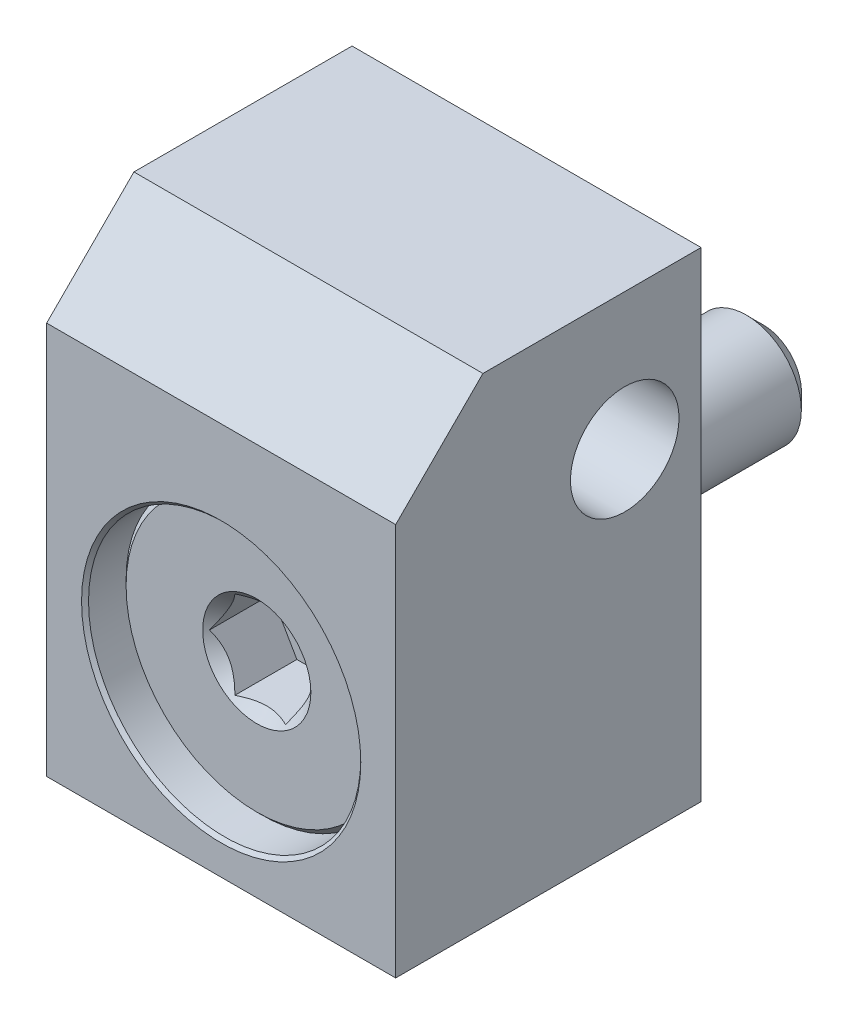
ISO-10303-21;
HEADER;
FILE_DESCRIPTION(('STEP AP214'),'2;1');
FILE_NAME('part.step','',(''),(''),'','','');
FILE_SCHEMA(('AUTOMOTIVE_DESIGN { 1 0 10303 214 1 1 1 1 }'));
ENDSEC;
DATA;
#1=APPLICATION_CONTEXT('core data for automotive mechanical design processes');
#2=APPLICATION_PROTOCOL_DEFINITION('international standard','automotive_design',2000,#1);
#3=PRODUCT_CONTEXT('',#1,'mechanical');
#4=PRODUCT('Part','Part','',(#3));
#5=PRODUCT_RELATED_PRODUCT_CATEGORY('part','',(#4));
#6=PRODUCT_DEFINITION_FORMATION('','',#4);
#7=PRODUCT_DEFINITION_CONTEXT('part definition',#1,'design');
#8=PRODUCT_DEFINITION('design','',#6,#7);
#9=PRODUCT_DEFINITION_SHAPE('','',#8);
#10=(LENGTH_UNIT() NAMED_UNIT(*) SI_UNIT(.MILLI.,.METRE.));
#11=(NAMED_UNIT(*) PLANE_ANGLE_UNIT() SI_UNIT($,.RADIAN.));
#12=(NAMED_UNIT(*) SI_UNIT($,.STERADIAN.) SOLID_ANGLE_UNIT());
#13=UNCERTAINTY_MEASURE_WITH_UNIT(LENGTH_MEASURE(1.E-05),#10,'distance_accuracy_value','');
#14=(GEOMETRIC_REPRESENTATION_CONTEXT(3) GLOBAL_UNCERTAINTY_ASSIGNED_CONTEXT((#13)) GLOBAL_UNIT_ASSIGNED_CONTEXT((#10,
#11,#12)) REPRESENTATION_CONTEXT('',''));
#15=CARTESIAN_POINT('',(0.,0.,0.));
#16=DIRECTION('',(0.,0.,1.));
#17=DIRECTION('',(1.,0.,0.));
#18=AXIS2_PLACEMENT_3D('',#15,#16,#17);
#19=CARTESIAN_POINT('',(1.8440856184,-3.19405,16.2683675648));
#20=DIRECTION('',(0.866025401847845,-0.500000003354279,0.));
#21=DIRECTION('',(0.500000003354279,0.866025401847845,0.));
#22=AXIS2_PLACEMENT_3D('',#19,#20,#21);
#23=PLANE('',#22);
#24=CARTESIAN_POINT('',(3.6881712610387,-1.7484970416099E-09,20.7820388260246));
#25=CARTESIAN_POINT('',(3.62478914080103,-0.109781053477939,20.7187175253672));
#26=CARTESIAN_POINT('',(3.56034726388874,-0.221397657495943,20.6591158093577));
#27=CARTESIAN_POINT('',(3.42894366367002,-0.448995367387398,20.5499876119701));
#28=CARTESIAN_POINT('',(3.36196945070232,-0.564998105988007,20.5005218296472));
#29=CARTESIAN_POINT('',(3.22691924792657,-0.798911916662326,20.4157866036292));
#30=CARTESIAN_POINT('',(3.15887763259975,-0.916763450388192,20.3803042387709));
#31=CARTESIAN_POINT('',(3.02129683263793,-1.15506038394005,20.325636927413));
#32=CARTESIAN_POINT('',(2.95176184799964,-1.27549850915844,20.3064111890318));
#33=CARTESIAN_POINT('',(2.83191525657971,-1.48307889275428,20.2890640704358));
#34=CARTESIAN_POINT('',(2.78175832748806,-1.56995324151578,20.2864968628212));
#35=CARTESIAN_POINT('',(2.68152611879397,-1.74356051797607,20.2908274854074));
#36=CARTESIAN_POINT('',(2.63145087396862,-1.83029338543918,20.2977286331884));
#37=CARTESIAN_POINT('',(2.53177486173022,-2.00293730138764,20.3206019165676));
#38=CARTESIAN_POINT('',(2.48217468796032,-2.08884732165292,20.3365841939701));
#39=CARTESIAN_POINT('',(2.38382622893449,-2.25919184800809,20.3767474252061));
#40=CARTESIAN_POINT('',(2.335077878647,-2.34362646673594,20.4009277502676));
#41=CARTESIAN_POINT('',(2.24854692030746,-2.49350248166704,20.4506707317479));
#42=CARTESIAN_POINT('',(2.21057255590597,-2.55927600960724,20.4749243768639));
#43=CARTESIAN_POINT('',(2.13530537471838,-2.68964259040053,20.5273394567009));
#44=CARTESIAN_POINT('',(2.09801257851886,-2.75423560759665,20.5555010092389));
#45=CARTESIAN_POINT('',(2.0242260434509,-2.88203763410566,20.6151008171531));
#46=CARTESIAN_POINT('',(1.98773020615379,-2.94525027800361,20.646528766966));
#47=CARTESIAN_POINT('',(1.91541422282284,-3.07050523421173,20.7122488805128));
#48=CARTESIAN_POINT('',(1.87959367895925,-3.13254823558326,20.7465392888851));
#49=CARTESIAN_POINT('',(1.84408561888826,-3.19404999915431,20.7820388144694));
#50=B_SPLINE_CURVE_WITH_KNOTS('',3,(#24,#25,#26,#27,#28,#29,#30,#31,#32,#33,#34,#35,#36,#37,#38,
#39,#40,#41,#42,#43,#44,#45,#46,#47,#48,#49),.UNSPECIFIED.,.F.,.F.,(4,2,2,2,2,2,2,2,2,2,2,2,4),
(0.,0.425392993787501,0.853263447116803,1.27434076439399,1.69435833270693,1.99497286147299,
2.2956927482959,2.59674914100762,2.89778244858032,3.1368524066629,3.37592957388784,
3.61427411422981,3.85247355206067),.UNSPECIFIED.);
#51=CARTESIAN_POINT('',(3.68817126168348,-8.94631599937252E-10,20.7820388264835));
#52=VERTEX_POINT('',#51);
#53=CARTESIAN_POINT('',(1.84408561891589,-3.19405,20.7820388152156));
#54=VERTEX_POINT('',#53);
#55=EDGE_CURVE('E229',#52,#54,#50,.T.);
#56=ORIENTED_EDGE('',*,*,#55,.F.);
#57=DIRECTION('',(0.,0.,1.));
#58=VECTOR('',#57,1.);
#59=CARTESIAN_POINT('',(3.6881712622,0.,18.5387442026));
#60=LINE('',#59,#58);
#61=CARTESIAN_POINT('',(3.6881712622,0.,16.2683675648));
#62=VERTEX_POINT('',#61);
#63=EDGE_CURVE('E160',#62,#52,#60,.T.);
#64=ORIENTED_EDGE('',*,*,#63,.F.);
#65=DIRECTION('',(0.50000000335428,0.866025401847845,0.));
#66=VECTOR('',#65,1.);
#67=CARTESIAN_POINT('',(2.7661284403,-1.597025,16.2683675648));
#68=LINE('',#67,#66);
#69=CARTESIAN_POINT('',(1.8440856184,-3.19405,16.2683675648));
#70=VERTEX_POINT('',#69);
#71=EDGE_CURVE('E156',#70,#62,#68,.T.);
#72=ORIENTED_EDGE('',*,*,#71,.F.);
#73=DIRECTION('',(0.,0.,1.));
#74=VECTOR('',#73,1.);
#75=CARTESIAN_POINT('',(1.8440856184,-3.19405,18.5387442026));
#76=LINE('',#75,#74);
#77=EDGE_CURVE('E159',#70,#54,#76,.T.);
#78=ORIENTED_EDGE('',*,*,#77,.T.);
#79=EDGE_LOOP('',(#56,#64,#72,#78));
#80=FACE_BOUND('',#79,.T.);
#81=ADVANCED_FACE('F14',(#80),#23,.F.);
#82=CARTESIAN_POINT('',(-1.8440856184,-3.19405,16.2683675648));
#83=DIRECTION('',(0.,-1.,0.));
#84=DIRECTION('',(1.,0.,0.));
#85=AXIS2_PLACEMENT_3D('',#82,#83,#84);
#86=PLANE('',#85);
#87=CARTESIAN_POINT('',(1.84408561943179,-3.19405,20.7820388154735));
#88=CARTESIAN_POINT('',(1.7173213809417,-3.19405,20.7187175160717));
#89=CARTESIAN_POINT('',(1.58843762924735,-3.19405,20.659115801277));
#90=CARTESIAN_POINT('',(1.32563043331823,-3.19405,20.549987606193));
#91=CARTESIAN_POINT('',(1.19168200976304,-3.19405,20.5005218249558));
#92=CARTESIAN_POINT('',(0.921581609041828,-3.19405,20.4157866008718));
#93=CARTESIAN_POINT('',(0.785498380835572,-3.19405,20.3803042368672));
#94=CARTESIAN_POINT('',(0.51033678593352,-3.19405,20.325636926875));
#95=CARTESIAN_POINT('',(0.371266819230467,-3.19405,20.306411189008));
#96=CARTESIAN_POINT('',(0.131573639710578,-3.19405,20.2890640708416));
#97=CARTESIAN_POINT('',(0.031259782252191,-3.19405,20.2864968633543));
#98=CARTESIAN_POINT('',(-0.169204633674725,-3.19405,20.2908274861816));
#99=CARTESIAN_POINT('',(-0.269355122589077,-3.19405,20.2977286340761));
#100=CARTESIAN_POINT('',(-0.468707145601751,-3.19405,20.3206019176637));
#101=CARTESIAN_POINT('',(-0.567907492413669,-3.19405,20.3365841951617));
#102=CARTESIAN_POINT('',(-0.764604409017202,-3.19405,20.3767474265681));
#103=CARTESIAN_POINT('',(-0.862101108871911,-3.19405,20.4009277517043));
#104=CARTESIAN_POINT('',(-1.03516302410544,-3.19405,20.450670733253));
#105=CARTESIAN_POINT('',(-1.11111175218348,-3.19405,20.4749243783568));
#106=CARTESIAN_POINT('',(-1.26164611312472,-3.19405,20.5273394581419));
#107=CARTESIAN_POINT('',(-1.3362317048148,-3.19405,20.5555010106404));
#108=CARTESIAN_POINT('',(-1.48380477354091,-3.19405,20.6151008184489));
#109=CARTESIAN_POINT('',(-1.55679644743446,-3.19405,20.6465287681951));
#110=CARTESIAN_POINT('',(-1.70142841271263,-3.19405,20.7122488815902));
#111=CARTESIAN_POINT('',(-1.77306949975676,-3.19405,20.7465392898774));
#112=CARTESIAN_POINT('',(-1.84408561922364,-3.19405,20.7820388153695));
#113=B_SPLINE_CURVE_WITH_KNOTS('',3,(#87,#88,#89,#90,#91,#92,#93,#94,#95,#96,#97,#98,#99,#100,
#101,#102,#103,#104,#105,#106,#107,#108,#109,#110,#111,#112),.UNSPECIFIED.,.F.,.F.,(4,2,2,2,2,2,
2,2,2,2,2,2,4),(0.,0.425392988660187,0.85326343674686,1.27434074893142,1.69435831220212,
1.99497284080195,2.29569272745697,2.59674912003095,2.89778242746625,3.13685238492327,
3.3759295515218,3.61427409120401,3.85247352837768),.UNSPECIFIED.);
#114=CARTESIAN_POINT('',(-1.84408561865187,-3.19404999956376,20.7820388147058));
#115=VERTEX_POINT('',#114);
#116=EDGE_CURVE('E196',#54,#115,#113,.T.);
#117=ORIENTED_EDGE('',*,*,#116,.F.);
#118=ORIENTED_EDGE('',*,*,#77,.F.);
#119=DIRECTION('',(1.,0.,0.));
#120=VECTOR('',#119,1.);
#121=CARTESIAN_POINT('',(0.,-3.19405,16.2683675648));
#122=LINE('',#121,#120);
#123=CARTESIAN_POINT('',(-1.8440856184,-3.19405,16.2683675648));
#124=VERTEX_POINT('',#123);
#125=EDGE_CURVE('E161',#124,#70,#122,.T.);
#126=ORIENTED_EDGE('',*,*,#125,.F.);
#127=DIRECTION('',(0.,0.,-1.));
#128=VECTOR('',#127,1.);
#129=CARTESIAN_POINT('',(-1.8440856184,-3.19405,18.5387442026));
#130=LINE('',#129,#128);
#131=EDGE_CURVE('E164',#115,#124,#130,.T.);
#132=ORIENTED_EDGE('',*,*,#131,.F.);
#133=EDGE_LOOP('',(#117,#118,#126,#132));
#134=FACE_BOUND('',#133,.T.);
#135=ADVANCED_FACE('F270',(#134),#86,.F.);
#136=CARTESIAN_POINT('',(-3.6881712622,0.,16.2683675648));
#137=DIRECTION('',(-0.866025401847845,-0.500000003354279,0.));
#138=DIRECTION('',(0.500000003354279,-0.866025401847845,0.));
#139=AXIS2_PLACEMENT_3D('',#136,#137,#138);
#140=PLANE('',#139);
#141=CARTESIAN_POINT('',(-1.84408561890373,-3.19404999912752,20.782038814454));
#142=CARTESIAN_POINT('',(-1.90746773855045,-3.08426894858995,20.7187175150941));
#143=CARTESIAN_POINT('',(-1.97190961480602,-2.97265234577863,20.6591158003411));
#144=CARTESIAN_POINT('',(-2.10331321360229,-2.74505463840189,20.5499876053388));
#145=CARTESIAN_POINT('',(-2.17028742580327,-2.62905190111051,20.5005218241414));
#146=CARTESIAN_POINT('',(-2.3053376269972,-2.39513809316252,20.4157866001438));
#147=CARTESIAN_POINT('',(-2.37337924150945,-2.27728656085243,20.3803042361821));
#148=CARTESIAN_POINT('',(-2.51096003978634,-2.03898963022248,20.3256369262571));
#149=CARTESIAN_POINT('',(-2.58049502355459,-1.91855150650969,20.3064111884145));
#150=CARTESIAN_POINT('',(-2.7003416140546,-1.71097112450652,20.2890640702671));
#151=CARTESIAN_POINT('',(-2.75049854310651,-1.62409677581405,20.2864968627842));
#152=CARTESIAN_POINT('',(-2.85073075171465,-1.45048949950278,20.2908274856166));
#153=CARTESIAN_POINT('',(-2.90080599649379,-1.36375663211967,20.297728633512));
#154=CARTESIAN_POINT('',(-3.00048200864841,-1.19111271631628,20.3206019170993));
#155=CARTESIAN_POINT('',(-3.0500821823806,-1.10520269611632,20.3365841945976));
#156=CARTESIAN_POINT('',(-3.14843064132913,-0.934858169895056,20.3767474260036));
#157=CARTESIAN_POINT('',(-3.19717899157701,-0.850423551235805,20.4009277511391));
#158=CARTESIAN_POINT('',(-3.28370995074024,-0.700547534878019,20.4506707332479));
#159=CARTESIAN_POINT('',(-3.32168431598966,-0.634774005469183,20.4749243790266));
#160=CARTESIAN_POINT('',(-3.39695149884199,-0.504407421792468,20.5273394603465));
#161=CARTESIAN_POINT('',(-3.43424429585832,-0.439814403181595,20.5555010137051));
#162=CARTESIAN_POINT('',(-3.50803083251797,-0.312012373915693,20.6151008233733));
#163=CARTESIAN_POINT('',(-3.54452667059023,-0.248799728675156,20.6465287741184));
#164=CARTESIAN_POINT('',(-3.61684265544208,-0.123544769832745,20.7122488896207));
#165=CARTESIAN_POINT('',(-3.65266320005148,-0.0615017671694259,20.7465392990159));
#166=CARTESIAN_POINT('',(-3.68817126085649,-2.32702668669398E-09,20.7820388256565));
#167=B_SPLINE_CURVE_WITH_KNOTS('',3,(#141,#142,#143,#144,#145,#146,#147,#148,#149,#150,#151,
#152,#153,#154,#155,#156,#157,#158,#159,#160,#161,#162,#163,#164,#165,#166),.UNSPECIFIED.,.F.,
.F.,(4,2,2,2,2,2,2,2,2,2,2,2,4),(0.,0.425392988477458,0.853263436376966,1.27434074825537,
1.69435831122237,1.99497283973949,2.29569272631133,2.59674911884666,2.89778242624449,
3.13685238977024,3.37592956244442,3.61427410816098,3.85247355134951),.UNSPECIFIED.);
#168=CARTESIAN_POINT('',(-3.68817126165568,9.42790922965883E-10,20.7820388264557));
#169=VERTEX_POINT('',#168);
#170=EDGE_CURVE('E187',#115,#169,#167,.T.);
#171=ORIENTED_EDGE('',*,*,#170,.F.);
#172=ORIENTED_EDGE('',*,*,#131,.T.);
#173=DIRECTION('',(0.50000000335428,-0.866025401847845,0.));
#174=VECTOR('',#173,1.);
#175=CARTESIAN_POINT('',(-2.7661284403,-1.597025,16.2683675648));
#176=LINE('',#175,#174);
#177=CARTESIAN_POINT('',(-3.6881712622,0.,16.2683675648));
#178=VERTEX_POINT('',#177);
#179=EDGE_CURVE('E165',#178,#124,#176,.T.);
#180=ORIENTED_EDGE('',*,*,#179,.F.);
#181=DIRECTION('',(0.,0.,-1.));
#182=VECTOR('',#181,1.);
#183=CARTESIAN_POINT('',(-3.6881712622,0.,18.5387442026));
#184=LINE('',#183,#182);
#185=EDGE_CURVE('E168',#169,#178,#184,.T.);
#186=ORIENTED_EDGE('',*,*,#185,.F.);
#187=EDGE_LOOP('',(#171,#172,#180,#186));
#188=FACE_BOUND('',#187,.T.);
#189=ADVANCED_FACE('F203',(#188),#140,.F.);
#190=CARTESIAN_POINT('',(-1.8440856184,3.19405,16.2683675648));
#191=DIRECTION('',(-0.866025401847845,0.500000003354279,0.));
#192=DIRECTION('',(-0.500000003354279,-0.866025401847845,0.));
#193=AXIS2_PLACEMENT_3D('',#190,#191,#192);
#194=PLANE('',#193);
#195=CARTESIAN_POINT('',(-3.68817125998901,1.52885915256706E-09,20.7820388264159));
#196=CARTESIAN_POINT('',(-3.6247891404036,0.109781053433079,20.7187175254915));
#197=CARTESIAN_POINT('',(-3.56034726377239,0.221397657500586,20.6591158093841));
#198=CARTESIAN_POINT('',(-3.42894366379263,0.44899536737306,20.5499876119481));
#199=CARTESIAN_POINT('',(-3.36196945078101,0.564998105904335,20.5005218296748));
#200=CARTESIAN_POINT('',(-3.22691924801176,0.79891191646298,20.4157866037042));
#201=CARTESIAN_POINT('',(-3.15887763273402,0.916763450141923,20.3803042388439));
#202=CARTESIAN_POINT('',(-3.02129683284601,1.15506038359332,20.3256369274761));
#203=CARTESIAN_POINT('',(-2.95176184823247,1.27549850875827,20.3064111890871));
#204=CARTESIAN_POINT('',(-2.83191525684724,1.48307889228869,20.289064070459));
#205=CARTESIAN_POINT('',(-2.78175832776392,1.56995324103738,20.2864968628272));
#206=CARTESIAN_POINT('',(-2.68152611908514,1.74356051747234,20.290827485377));
#207=CARTESIAN_POINT('',(-2.63145087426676,1.83029338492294,20.2977286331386));
#208=CARTESIAN_POINT('',(-2.53177486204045,2.00293730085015,20.3206019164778));
#209=CARTESIAN_POINT('',(-2.48217468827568,2.08884732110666,20.3365841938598));
#210=CARTESIAN_POINT('',(-2.38382622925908,2.25919184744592,20.3767474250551));
#211=CARTESIAN_POINT('',(-2.3350778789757,2.34362646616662,20.4009277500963));
#212=CARTESIAN_POINT('',(-2.24854692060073,2.49350248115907,20.4506707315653));
#213=CARTESIAN_POINT('',(-2.21057255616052,2.55927600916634,20.4749243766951));
#214=CARTESIAN_POINT('',(-2.13530537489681,2.68964259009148,20.5273394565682));
#215=CARTESIAN_POINT('',(-2.09801257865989,2.75423560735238,20.5555010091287));
#216=CARTESIAN_POINT('',(-2.02422604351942,2.88203763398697,20.6151008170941));
#217=CARTESIAN_POINT('',(-1.98773020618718,2.94525027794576,20.6465287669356));
#218=CARTESIAN_POINT('',(-1.91541422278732,3.07050523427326,20.7122488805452));
#219=CARTESIAN_POINT('',(-1.87959367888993,3.13254823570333,20.7465392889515));
#220=CARTESIAN_POINT('',(-1.84408561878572,3.19404999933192,20.782038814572));
#221=B_SPLINE_CURVE_WITH_KNOTS('',3,(#195,#196,#197,#198,#199,#200,#201,#202,#203,#204,#205,
#206,#207,#208,#209,#210,#211,#212,#213,#214,#215,#216,#217,#218,#219,#220),.UNSPECIFIED.,.F.,
.F.,(4,2,2,2,2,2,2,2,2,2,2,2,4),(0.,0.425392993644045,0.853263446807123,1.27434076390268,
1.69435833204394,1.99497286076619,2.29569274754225,2.59674914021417,2.8977824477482,
3.13685240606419,3.37592957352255,3.61427411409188,3.85247355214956),.UNSPECIFIED.);
#222=CARTESIAN_POINT('',(-1.84408561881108,3.19405,20.7820388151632));
#223=VERTEX_POINT('',#222);
#224=EDGE_CURVE('E155',#169,#223,#221,.T.);
#225=ORIENTED_EDGE('',*,*,#224,.F.);
#226=ORIENTED_EDGE('',*,*,#185,.T.);
#227=DIRECTION('',(-0.50000000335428,-0.866025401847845,0.));
#228=VECTOR('',#227,1.);
#229=CARTESIAN_POINT('',(-2.7661284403,1.597025,16.2683675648));
#230=LINE('',#229,#228);
#231=CARTESIAN_POINT('',(-1.8440856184,3.19405,16.2683675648));
#232=VERTEX_POINT('',#231);
#233=EDGE_CURVE('E90',#232,#178,#230,.T.);
#234=ORIENTED_EDGE('',*,*,#233,.F.);
#235=DIRECTION('',(0.,0.,1.));
#236=VECTOR('',#235,1.);
#237=CARTESIAN_POINT('',(-1.8440856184,3.19405,18.5387442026));
#238=LINE('',#237,#236);
#239=EDGE_CURVE('E170',#232,#223,#238,.T.);
#240=ORIENTED_EDGE('',*,*,#239,.T.);
#241=EDGE_LOOP('',(#225,#226,#234,#240));
#242=FACE_BOUND('',#241,.T.);
#243=ADVANCED_FACE('F257',(#242),#194,.F.);
#244=CARTESIAN_POINT('',(1.8440856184,3.19405,16.2683675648));
#245=DIRECTION('',(0.,1.,0.));
#246=DIRECTION('',(-1.,0.,0.));
#247=AXIS2_PLACEMENT_3D('',#244,#245,#246);
#248=PLANE('',#247);
#249=CARTESIAN_POINT('',(-1.84408561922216,3.19405,20.7820388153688));
#250=CARTESIAN_POINT('',(-1.71732138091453,3.19405,20.7187175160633));
#251=CARTESIAN_POINT('',(-1.58843762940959,3.19405,20.6591158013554));
#252=CARTESIAN_POINT('',(-1.32563043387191,3.19405,20.5499876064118));
#253=CARTESIAN_POINT('',(-1.19168201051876,3.19405,20.5005218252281));
#254=CARTESIAN_POINT('',(-0.921581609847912,3.19405,20.4157866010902));
#255=CARTESIAN_POINT('',(-0.78549838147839,3.19405,20.3803042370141));
#256=CARTESIAN_POINT('',(-0.510336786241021,3.19405,20.325636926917));
#257=CARTESIAN_POINT('',(-0.37126681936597,3.19405,20.3064111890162));
#258=CARTESIAN_POINT('',(-0.131573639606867,3.19405,20.2890640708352));
#259=CARTESIAN_POINT('',(-0.0312597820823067,3.19405,20.2864968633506));
#260=CARTESIAN_POINT('',(0.169204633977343,3.19405,20.2908274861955));
#261=CARTESIAN_POINT('',(0.269355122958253,3.19405,20.2977286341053));
#262=CARTESIAN_POINT('',(0.468707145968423,3.19405,20.320601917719));
#263=CARTESIAN_POINT('',(0.567907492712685,3.19405,20.3365841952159));
#264=CARTESIAN_POINT('',(0.764604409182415,3.19405,20.3767474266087));
#265=CARTESIAN_POINT('',(0.862101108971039,3.19405,20.4009277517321));
#266=CARTESIAN_POINT('',(1.03516300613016,3.19405,20.450670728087));
#267=CARTESIAN_POINT('',(1.11111171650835,3.19405,20.4749243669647));
#268=CARTESIAN_POINT('',(1.26164604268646,3.19405,20.5273394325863));
#269=CARTESIAN_POINT('',(1.33623161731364,3.19405,20.5555009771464));
#270=CARTESIAN_POINT('',(1.4838046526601,3.19405,20.6151007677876));
#271=CARTESIAN_POINT('',(1.55679631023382,3.19405,20.6465287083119));
#272=CARTESIAN_POINT('',(1.70142824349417,3.19405,20.7122488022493));
#273=CARTESIAN_POINT('',(1.77306931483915,3.19405,20.7465392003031));
#274=CARTESIAN_POINT('',(1.84408541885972,3.19405,20.7820387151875));
#275=B_SPLINE_CURVE_WITH_KNOTS('',3,(#249,#250,#251,#252,#253,#254,#255,#256,#257,#258,#259,
#260,#261,#262,#263,#264,#265,#266,#267,#268,#269,#270,#271,#272,#273,#274),.UNSPECIFIED.,.F.,
.F.,(4,2,2,2,2,2,2,2,2,2,2,2,4),(0.,0.425392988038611,0.853263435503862,1.27434074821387,
1.6943583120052,1.99497284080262,2.29569272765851,2.59674912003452,2.89778242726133,
3.13685232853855,3.37592943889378,3.61427392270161,3.85247330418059),.UNSPECIFIED.);
#276=CARTESIAN_POINT('',(1.84408560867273,3.19405001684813,20.782038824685));
#277=VERTEX_POINT('',#276);
#278=EDGE_CURVE('E57',#223,#277,#275,.T.);
#279=ORIENTED_EDGE('',*,*,#278,.F.);
#280=ORIENTED_EDGE('',*,*,#239,.F.);
#281=DIRECTION('',(-1.,0.,0.));
#282=VECTOR('',#281,1.);
#283=CARTESIAN_POINT('',(0.,3.19405,16.2683675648));
#284=LINE('',#283,#282);
#285=CARTESIAN_POINT('',(1.8440856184,3.19405,16.2683675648));
#286=VERTEX_POINT('',#285);
#287=EDGE_CURVE('E94',#286,#232,#284,.T.);
#288=ORIENTED_EDGE('',*,*,#287,.F.);
#289=DIRECTION('',(0.,0.,1.));
#290=VECTOR('',#289,1.);
#291=CARTESIAN_POINT('',(1.8440856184,3.19405,18.5387442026));
#292=LINE('',#291,#290);
#293=EDGE_CURVE('E172',#286,#277,#292,.T.);
#294=ORIENTED_EDGE('',*,*,#293,.T.);
#295=EDGE_LOOP('',(#279,#280,#288,#294));
#296=FACE_BOUND('',#295,.T.);
#297=ADVANCED_FACE('F244',(#296),#248,.F.);
#298=CARTESIAN_POINT('',(3.6881712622,0.,16.2683675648));
#299=DIRECTION('',(0.866025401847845,0.500000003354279,0.));
#300=DIRECTION('',(-0.500000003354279,0.866025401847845,0.));
#301=AXIS2_PLACEMENT_3D('',#298,#299,#300);
#302=PLANE('',#301);
#303=CARTESIAN_POINT('',(1.84408553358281,3.19404997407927,20.7820388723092));
#304=CARTESIAN_POINT('',(1.90746769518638,3.08426896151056,20.7187175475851));
#305=CARTESIAN_POINT('',(1.97190958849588,2.97265237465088,20.6591158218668));
#306=CARTESIAN_POINT('',(2.10331319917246,2.74505468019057,20.5499876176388));
#307=CARTESIAN_POINT('',(2.17028740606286,2.62905193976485,20.5005218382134));
#308=CARTESIAN_POINT('',(2.30533760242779,2.3951381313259,20.4157866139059));
#309=CARTESIAN_POINT('',(2.37337921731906,2.27728660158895,20.3803042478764));
#310=CARTESIAN_POINT('',(2.51096001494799,2.03898967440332,20.3256369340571));
#311=CARTESIAN_POINT('',(2.58049499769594,1.91855155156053,20.3064111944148));
#312=CARTESIAN_POINT('',(2.7003415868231,1.71097117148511,20.2890640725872));
#313=CARTESIAN_POINT('',(2.75049851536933,1.62409682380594,20.2864968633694));
#314=CARTESIAN_POINT('',(2.85073072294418,1.45048954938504,20.2908274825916));
#315=CARTESIAN_POINT('',(2.9008059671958,1.36375668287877,20.2977286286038));
#316=CARTESIAN_POINT('',(3.00048197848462,1.19111276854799,20.3206019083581));
#317=CARTESIAN_POINT('',(3.05008215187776,1.10520274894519,20.3365841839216));
#318=CARTESIAN_POINT('',(3.14843061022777,0.934858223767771,20.3767474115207));
#319=CARTESIAN_POINT('',(3.19717896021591,0.850423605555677,20.4009277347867));
#320=CARTESIAN_POINT('',(3.28370992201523,0.700547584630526,20.4506707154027));
#321=CARTESIAN_POINT('',(3.3216842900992,0.634774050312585,20.474924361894));
#322=CARTESIAN_POINT('',(3.39695147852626,0.504407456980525,20.5273394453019));
#323=CARTESIAN_POINT('',(3.43424427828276,0.439814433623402,20.5555010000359));
#324=CARTESIAN_POINT('',(3.50803082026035,0.312012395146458,20.6151008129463));
#325=CARTESIAN_POINT('',(3.5445266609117,0.24879974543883,20.6465287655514));
#326=CARTESIAN_POINT('',(3.61684265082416,0.123544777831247,20.7122488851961));
#327=CARTESIAN_POINT('',(3.6526631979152,0.0615017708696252,20.7465392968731));
#328=CARTESIAN_POINT('',(3.68817126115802,1.8047641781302E-09,20.782038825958));
#329=B_SPLINE_CURVE_WITH_KNOTS('',3,(#303,#304,#305,#306,#307,#308,#309,#310,#311,#312,#313,
#314,#315,#316,#317,#318,#319,#320,#321,#322,#323,#324,#325,#326,#327,#328),.UNSPECIFIED.,.F.,
.F.,(4,2,2,2,2,2,2,2,2,2,2,2,4),(0.,0.425392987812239,0.853263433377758,1.27434074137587,
1.6943583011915,1.99497282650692,2.29569270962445,2.59674909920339,2.89778240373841,
3.1368523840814,3.37592957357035,3.61427413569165,3.85247359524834),.UNSPECIFIED.);
#330=EDGE_CURVE('E50',#277,#52,#329,.T.);
#331=ORIENTED_EDGE('',*,*,#330,.F.);
#332=ORIENTED_EDGE('',*,*,#293,.F.);
#333=DIRECTION('',(-0.50000000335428,0.866025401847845,0.));
#334=VECTOR('',#333,1.);
#335=CARTESIAN_POINT('',(2.7661284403,1.597025,16.2683675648));
#336=LINE('',#335,#334);
#337=EDGE_CURVE('E173',#62,#286,#336,.T.);
#338=ORIENTED_EDGE('',*,*,#337,.F.);
#339=ORIENTED_EDGE('',*,*,#63,.T.);
#340=EDGE_LOOP('',(#331,#332,#338,#339));
#341=FACE_BOUND('',#340,.T.);
#342=ADVANCED_FACE('F240',(#341),#302,.F.);
#343=CARTESIAN_POINT('',(-3.6881712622,-3.19405,16.2683675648));
#344=DIRECTION('',(0.,0.,1.));
#345=DIRECTION('',(1.,0.,0.));
#346=AXIS2_PLACEMENT_3D('',#343,#344,#345);
#347=PLANE('',#346);
#348=ORIENTED_EDGE('',*,*,#179,.T.);
#349=ORIENTED_EDGE('',*,*,#125,.T.);
#350=ORIENTED_EDGE('',*,*,#71,.T.);
#351=ORIENTED_EDGE('',*,*,#337,.T.);
#352=ORIENTED_EDGE('',*,*,#287,.T.);
#353=ORIENTED_EDGE('',*,*,#233,.T.);
#354=EDGE_LOOP('',(#348,#349,#350,#351,#352,#353));
#355=FACE_BOUND('',#354,.T.);
#356=ADVANCED_FACE('F243',(#355),#347,.T.);
#357=CARTESIAN_POINT('',(-9.62387712,-9.62387712,21.0308675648));
#358=DIRECTION('',(0.,0.,1.));
#359=DIRECTION('',(1.,0.,0.));
#360=AXIS2_PLACEMENT_3D('',#357,#358,#359);
#361=PLANE('',#360);
#362=CARTESIAN_POINT('',(0.,0.,21.0308675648));
#363=DIRECTION('',(0.,0.,1.));
#364=DIRECTION('',(1.,0.,0.));
#365=AXIS2_PLACEMENT_3D('',#362,#363,#364);
#366=CIRCLE('',#365,3.937);
#367=CARTESIAN_POINT('',(3.937,0.,21.0308675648));
#368=VERTEX_POINT('',#367);
#369=EDGE_CURVE('E29',#368,#368,#366,.T.);
#370=ORIENTED_EDGE('',*,*,#369,.F.);
#371=EDGE_LOOP('',(#370));
#372=FACE_BOUND('',#371,.T.);
#373=CARTESIAN_POINT('',(0.,0.,21.0308675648));
#374=DIRECTION('',(0.,0.,-1.));
#375=DIRECTION('',(-1.,0.,0.));
#376=AXIS2_PLACEMENT_3D('',#373,#374,#375);
#377=CIRCLE('',#376,9.50976);
#378=CARTESIAN_POINT('',(-9.50976,0.,21.0308675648));
#379=VERTEX_POINT('',#378);
#380=EDGE_CURVE('E176',#379,#379,#377,.F.);
#381=ORIENTED_EDGE('',*,*,#380,.T.);
#382=EDGE_LOOP('',(#381));
#383=FACE_BOUND('',#382,.T.);
#384=ADVANCED_FACE('F214',(#372,#383),#361,.T.);
#385=CARTESIAN_POINT('',(0.,0.,21.0308675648));
#386=DIRECTION('',(0.,0.,-1.));
#387=DIRECTION('',(-1.,0.,0.));
#388=AXIS2_PLACEMENT_3D('',#385,#386,#387);
#389=CONICAL_SURFACE('',#388,9.50976,0.785398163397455);
#390=ORIENTED_EDGE('',*,*,#380,.F.);
#391=EDGE_LOOP('',(#390));
#392=FACE_BOUND('',#391,.T.);
#393=CARTESIAN_POINT('',(0.,0.,20.6346275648));
#394=DIRECTION('',(0.,0.,-1.));
#395=DIRECTION('',(-1.,0.,0.));
#396=AXIS2_PLACEMENT_3D('',#393,#394,#395);
#397=CIRCLE('',#396,9.906);
#398=CARTESIAN_POINT('',(-9.906,0.,20.6346275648));
#399=VERTEX_POINT('',#398);
#400=EDGE_CURVE('E336',#399,#399,#397,.T.);
#401=ORIENTED_EDGE('',*,*,#400,.F.);
#402=EDGE_LOOP('',(#401));
#403=FACE_BOUND('',#402,.T.);
#404=ADVANCED_FACE('F253',(#392,#403),#389,.T.);
#405=CARTESIAN_POINT('',(0.,0.,23.368));
#406=DIRECTION('',(0.,0.,-1.));
#407=DIRECTION('',(-1.,0.,0.));
#408=AXIS2_PLACEMENT_3D('',#405,#406,#407);
#409=CYLINDRICAL_SURFACE('',#408,9.906);
#410=ORIENTED_EDGE('',*,*,#400,.T.);
#411=EDGE_LOOP('',(#410));
#412=FACE_BOUND('',#411,.T.);
#413=CARTESIAN_POINT('',(0.,0.,23.368));
#414=DIRECTION('',(0.,0.,1.));
#415=DIRECTION('',(1.,0.,0.));
#416=AXIS2_PLACEMENT_3D('',#413,#414,#415);
#417=CIRCLE('',#416,9.906);
#418=CARTESIAN_POINT('',(9.906,0.,23.368));
#419=VERTEX_POINT('',#418);
#420=EDGE_CURVE('E337',#419,#419,#417,.F.);
#421=ORIENTED_EDGE('',*,*,#420,.F.);
#422=EDGE_LOOP('',(#421));
#423=FACE_BOUND('',#422,.T.);
#424=ADVANCED_FACE('F322',(#412,#423),#409,.F.);
#425=CARTESIAN_POINT('',(0.,0.,23.368));
#426=DIRECTION('',(0.,0.,1.));
#427=DIRECTION('',(1.,0.,0.));
#428=AXIS2_PLACEMENT_3D('',#425,#426,#427);
#429=CONICAL_SURFACE('',#428,9.906,0.785398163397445);
#430=CARTESIAN_POINT('',(0.,0.,23.622));
#431=DIRECTION('',(0.,0.,1.));
#432=DIRECTION('',(1.,0.,0.));
#433=AXIS2_PLACEMENT_3D('',#430,#431,#432);
#434=CIRCLE('',#433,10.16);
#435=CARTESIAN_POINT('',(10.16,0.,23.622));
#436=VERTEX_POINT('',#435);
#437=EDGE_CURVE('E340',#436,#436,#434,.T.);
#438=ORIENTED_EDGE('',*,*,#437,.T.);
#439=EDGE_LOOP('',(#438));
#440=FACE_BOUND('',#439,.T.);
#441=ORIENTED_EDGE('',*,*,#420,.T.);
#442=EDGE_LOOP('',(#441));
#443=FACE_BOUND('',#442,.T.);
#444=ADVANCED_FACE('F318',(#440,#443),#429,.F.);
#445=CARTESIAN_POINT('',(0.,0.,-14.986));
#446=DIRECTION('',(0.,0.,1.));
#447=DIRECTION('',(1.,0.,0.));
#448=AXIS2_PLACEMENT_3D('',#445,#446,#447);
#449=CYLINDRICAL_SURFACE('',#448,4.000000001);
#450=CARTESIAN_POINT('',(0.,0.,-14.6));
#451=DIRECTION('',(0.,0.,-1.));
#452=DIRECTION('',(-1.,0.,0.));
#453=AXIS2_PLACEMENT_3D('',#450,#451,#452);
#454=CIRCLE('',#453,4.000000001);
#455=CARTESIAN_POINT('',(-4.000000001,0.,-14.6));
#456=VERTEX_POINT('',#455);
#457=EDGE_CURVE('E9',#456,#456,#454,.F.);
#458=ORIENTED_EDGE('',*,*,#457,.T.);
#459=EDGE_LOOP('',(#458));
#460=FACE_BOUND('',#459,.T.);
#461=CARTESIAN_POINT('',(0.,0.,0.));
#462=DIRECTION('',(0.,0.,1.));
#463=DIRECTION('',(1.,0.,0.));
#464=AXIS2_PLACEMENT_3D('',#461,#462,#463);
#465=CIRCLE('',#464,4.000000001);
#466=CARTESIAN_POINT('',(4.000000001,0.,0.));
#467=VERTEX_POINT('',#466);
#468=EDGE_CURVE('E347',#467,#467,#465,.T.);
#469=ORIENTED_EDGE('',*,*,#468,.F.);
#470=EDGE_LOOP('',(#469));
#471=FACE_BOUND('',#470,.T.);
#472=ADVANCED_FACE('F314',(#460,#471),#449,.T.);
#473=CARTESIAN_POINT('',(-7.968488,-7.968488,0.));
#474=DIRECTION('',(0.,0.,1.));
#475=DIRECTION('',(1.,0.,0.));
#476=AXIS2_PLACEMENT_3D('',#473,#474,#475);
#477=PLANE('',#476);
#478=ORIENTED_EDGE('',*,*,#468,.T.);
#479=EDGE_LOOP('',(#478));
#480=FACE_BOUND('',#479,.T.);
#481=CARTESIAN_POINT('',(0.,0.,0.));
#482=DIRECTION('',(0.,0.,-1.));
#483=DIRECTION('',(-1.,0.,0.));
#484=AXIS2_PLACEMENT_3D('',#481,#482,#483);
#485=CIRCLE('',#484,7.874);
#486=CARTESIAN_POINT('',(-7.874,0.,0.));
#487=VERTEX_POINT('',#486);
#488=EDGE_CURVE('E350',#487,#487,#485,.F.);
#489=ORIENTED_EDGE('',*,*,#488,.F.);
#490=EDGE_LOOP('',(#489));
#491=FACE_BOUND('',#490,.T.);
#492=ADVANCED_FACE('F310',(#480,#491),#477,.F.);
#493=CARTESIAN_POINT('',(0.,0.,1.397));
#494=DIRECTION('',(0.,0.,-1.));
#495=DIRECTION('',(-1.,0.,0.));
#496=AXIS2_PLACEMENT_3D('',#493,#494,#495);
#497=CYLINDRICAL_SURFACE('',#496,7.874);
#498=CARTESIAN_POINT('',(0.,0.,1.397));
#499=DIRECTION('',(0.,0.,-1.));
#500=DIRECTION('',(-1.,0.,0.));
#501=AXIS2_PLACEMENT_3D('',#498,#499,#500);
#502=CIRCLE('',#501,7.874);
#503=CARTESIAN_POINT('',(-7.874,0.,1.397));
#504=VERTEX_POINT('',#503);
#505=EDGE_CURVE('E353',#504,#504,#502,.F.);
#506=ORIENTED_EDGE('',*,*,#505,.F.);
#507=EDGE_LOOP('',(#506));
#508=FACE_BOUND('',#507,.T.);
#509=ORIENTED_EDGE('',*,*,#488,.T.);
#510=EDGE_LOOP('',(#509));
#511=FACE_BOUND('',#510,.T.);
#512=ADVANCED_FACE('F306',(#508,#511),#497,.T.);
#513=CARTESIAN_POINT('',(-12.7,-12.319,1.397));
#514=DIRECTION('',(1.,0.,0.));
#515=DIRECTION('',(0.,1.,0.));
#516=AXIS2_PLACEMENT_3D('',#513,#514,#515);
#517=PLANE('',#516);
#518=CARTESIAN_POINT('',(-12.7,12.66825,6.95325000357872));
#519=DIRECTION('',(1.,0.,0.));
#520=DIRECTION('',(0.,0.,-1.));
#521=AXIS2_PLACEMENT_3D('',#518,#519,#520);
#522=CIRCLE('',#521,3.95);
#523=CARTESIAN_POINT('',(-12.7,12.66825,3.00325000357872));
#524=VERTEX_POINT('',#523);
#525=EDGE_CURVE('E183',#524,#524,#522,.T.);
#526=ORIENTED_EDGE('',*,*,#525,.T.);
#527=EDGE_LOOP('',(#526));
#528=FACE_BOUND('',#527,.T.);
#529=DIRECTION('',(0.,1.,0.));
#530=VECTOR('',#529,1.);
#531=CARTESIAN_POINT('',(-12.7,5.1435,1.397));
#532=LINE('',#531,#530);
#533=CARTESIAN_POINT('',(-12.7,-12.319,1.397));
#534=VERTEX_POINT('',#533);
#535=CARTESIAN_POINT('',(-12.7,22.606,1.397));
#536=VERTEX_POINT('',#535);
#537=EDGE_CURVE('E102',#534,#536,#532,.T.);
#538=ORIENTED_EDGE('',*,*,#537,.F.);
#539=DIRECTION('',(0.,0.,1.));
#540=VECTOR('',#539,1.);
#541=CARTESIAN_POINT('',(-12.7,-12.319,12.5095));
#542=LINE('',#541,#540);
#543=CARTESIAN_POINT('',(-12.7,-12.319,23.622));
#544=VERTEX_POINT('',#543);
#545=EDGE_CURVE('E356',#534,#544,#542,.T.);
#546=ORIENTED_EDGE('',*,*,#545,.T.);
#547=DIRECTION('',(0.,-1.,0.));
#548=VECTOR('',#547,1.);
#549=CARTESIAN_POINT('',(-12.7,5.1435,23.622));
#550=LINE('',#549,#548);
#551=CARTESIAN_POINT('',(-12.7,16.256,23.622));
#552=VERTEX_POINT('',#551);
#553=EDGE_CURVE('E358',#552,#544,#550,.T.);
#554=ORIENTED_EDGE('',*,*,#553,.F.);
#555=DIRECTION('',(0.,0.707106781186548,-0.707106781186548));
#556=VECTOR('',#555,1.);
#557=CARTESIAN_POINT('',(-12.7,16.256,23.622));
#558=LINE('',#557,#556);
#559=CARTESIAN_POINT('',(-12.7,22.606,17.272));
#560=VERTEX_POINT('',#559);
#561=EDGE_CURVE('E142',#560,#552,#558,.F.);
#562=ORIENTED_EDGE('',*,*,#561,.F.);
#563=DIRECTION('',(0.,0.,1.));
#564=VECTOR('',#563,1.);
#565=CARTESIAN_POINT('',(-12.7,22.606,12.5095));
#566=LINE('',#565,#564);
#567=EDGE_CURVE('E361',#536,#560,#566,.T.);
#568=ORIENTED_EDGE('',*,*,#567,.F.);
#569=EDGE_LOOP('',(#538,#546,#554,#562,#568));
#570=FACE_BOUND('',#569,.T.);
#571=CARTESIAN_POINT('',(-12.7,16.637,6.98500000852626));
#572=VERTEX_POINT('',#571);
#573=VERTEX_LOOP('',#572);
#574=FACE_BOUND('',#573,.T.);
#575=CARTESIAN_POINT('',(-12.7,8.6995,6.9850000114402));
#576=VERTEX_POINT('',#575);
#577=VERTEX_LOOP('',#576);
#578=FACE_BOUND('',#577,.T.);
#579=ADVANCED_FACE('F302',(#528,#570,#574,#578),#517,.F.);
#580=CARTESIAN_POINT('',(12.7,-12.319,1.397));
#581=DIRECTION('',(0.,1.,0.));
#582=DIRECTION('',(-1.,0.,0.));
#583=AXIS2_PLACEMENT_3D('',#580,#581,#582);
#584=PLANE('',#583);
#585=DIRECTION('',(1.,0.,0.));
#586=VECTOR('',#585,1.);
#587=CARTESIAN_POINT('',(0.,-12.319,1.397));
#588=LINE('',#587,#586);
#589=CARTESIAN_POINT('',(12.7,-12.319,1.397));
#590=VERTEX_POINT('',#589);
#591=EDGE_CURVE('E365',#534,#590,#588,.T.);
#592=ORIENTED_EDGE('',*,*,#591,.T.);
#593=DIRECTION('',(0.,0.,-1.));
#594=VECTOR('',#593,1.);
#595=CARTESIAN_POINT('',(12.7,-12.319,12.5095));
#596=LINE('',#595,#594);
#597=CARTESIAN_POINT('',(12.7,-12.319,23.622));
#598=VERTEX_POINT('',#597);
#599=EDGE_CURVE('E367',#598,#590,#596,.T.);
#600=ORIENTED_EDGE('',*,*,#599,.F.);
#601=DIRECTION('',(1.,0.,0.));
#602=VECTOR('',#601,1.);
#603=CARTESIAN_POINT('',(0.,-12.319,23.622));
#604=LINE('',#603,#602);
#605=EDGE_CURVE('E132',#544,#598,#604,.T.);
#606=ORIENTED_EDGE('',*,*,#605,.F.);
#607=ORIENTED_EDGE('',*,*,#545,.F.);
#608=EDGE_LOOP('',(#592,#600,#606,#607));
#609=FACE_BOUND('',#608,.T.);
#610=ADVANCED_FACE('F298',(#609),#584,.F.);
#611=CARTESIAN_POINT('',(12.7,-12.319,23.622));
#612=DIRECTION('',(0.,0.,-1.));
#613=DIRECTION('',(-1.,0.,0.));
#614=AXIS2_PLACEMENT_3D('',#611,#612,#613);
#615=PLANE('',#614);
#616=ORIENTED_EDGE('',*,*,#437,.F.);
#617=EDGE_LOOP('',(#616));
#618=FACE_BOUND('',#617,.T.);
#619=ORIENTED_EDGE('',*,*,#605,.T.);
#620=DIRECTION('',(0.,-1.,0.));
#621=VECTOR('',#620,1.);
#622=CARTESIAN_POINT('',(12.7,5.1435,23.622));
#623=LINE('',#622,#621);
#624=CARTESIAN_POINT('',(12.7,16.255999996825,23.622));
#625=VERTEX_POINT('',#624);
#626=EDGE_CURVE('E126',#625,#598,#623,.T.);
#627=ORIENTED_EDGE('',*,*,#626,.F.);
#628=DIRECTION('',(1.,0.,0.));
#629=VECTOR('',#628,1.);
#630=CARTESIAN_POINT('',(0.,16.256,23.622));
#631=LINE('',#630,#629);
#632=EDGE_CURVE('E130',#552,#625,#631,.T.);
#633=ORIENTED_EDGE('',*,*,#632,.F.);
#634=ORIENTED_EDGE('',*,*,#553,.T.);
#635=EDGE_LOOP('',(#619,#627,#633,#634));
#636=FACE_BOUND('',#635,.T.);
#637=ADVANCED_FACE('F128',(#618,#636),#615,.F.);
#638=CARTESIAN_POINT('',(-12.7,16.256,23.622));
#639=DIRECTION('',(0.,-0.707106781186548,-0.707106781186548));
#640=DIRECTION('',(0.,0.707106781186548,-0.707106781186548));
#641=AXIS2_PLACEMENT_3D('',#638,#639,#640);
#642=PLANE('',#641);
#643=ORIENTED_EDGE('',*,*,#632,.T.);
#644=DIRECTION('',(0.,-0.707106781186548,0.707106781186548));
#645=VECTOR('',#644,1.);
#646=CARTESIAN_POINT('',(12.7,22.606,17.27199999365));
#647=LINE('',#646,#645);
#648=CARTESIAN_POINT('',(12.7,22.606,17.271999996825));
#649=VERTEX_POINT('',#648);
#650=EDGE_CURVE('E141',#649,#625,#647,.T.);
#651=ORIENTED_EDGE('',*,*,#650,.F.);
#652=DIRECTION('',(1.,0.,0.));
#653=VECTOR('',#652,1.);
#654=CARTESIAN_POINT('',(0.,22.606,17.272));
#655=LINE('',#654,#653);
#656=EDGE_CURVE('E146',#560,#649,#655,.T.);
#657=ORIENTED_EDGE('',*,*,#656,.F.);
#658=ORIENTED_EDGE('',*,*,#561,.T.);
#659=EDGE_LOOP('',(#643,#651,#657,#658));
#660=FACE_BOUND('',#659,.T.);
#661=ADVANCED_FACE('F139',(#660),#642,.F.);
#662=CARTESIAN_POINT('',(-12.7,22.606,17.272));
#663=DIRECTION('',(0.,-1.,0.));
#664=DIRECTION('',(0.,0.,-1.));
#665=AXIS2_PLACEMENT_3D('',#662,#663,#664);
#666=PLANE('',#665);
#667=ORIENTED_EDGE('',*,*,#656,.T.);
#668=DIRECTION('',(0.,0.,1.));
#669=VECTOR('',#668,1.);
#670=CARTESIAN_POINT('',(12.7,22.606,12.5095));
#671=LINE('',#670,#669);
#672=CARTESIAN_POINT('',(12.7,22.606,1.397));
#673=VERTEX_POINT('',#672);
#674=EDGE_CURVE('E66',#673,#649,#671,.T.);
#675=ORIENTED_EDGE('',*,*,#674,.F.);
#676=DIRECTION('',(1.,0.,0.));
#677=VECTOR('',#676,1.);
#678=CARTESIAN_POINT('',(0.,22.606,1.397));
#679=LINE('',#678,#677);
#680=EDGE_CURVE('E151',#536,#673,#679,.T.);
#681=ORIENTED_EDGE('',*,*,#680,.F.);
#682=ORIENTED_EDGE('',*,*,#567,.T.);
#683=EDGE_LOOP('',(#667,#675,#681,#682));
#684=FACE_BOUND('',#683,.T.);
#685=ADVANCED_FACE('F290',(#684),#666,.F.);
#686=CARTESIAN_POINT('',(-12.7,5.3975,1.397));
#687=DIRECTION('',(0.,0.,1.));
#688=DIRECTION('',(0.,-1.,0.));
#689=AXIS2_PLACEMENT_3D('',#686,#687,#688);
#690=PLANE('',#689);
#691=ORIENTED_EDGE('',*,*,#591,.F.);
#692=ORIENTED_EDGE('',*,*,#537,.T.);
#693=ORIENTED_EDGE('',*,*,#680,.T.);
#694=DIRECTION('',(0.,1.,0.));
#695=VECTOR('',#694,1.);
#696=CARTESIAN_POINT('',(12.7,-3.46075,1.397));
#697=LINE('',#696,#695);
#698=EDGE_CURVE('E153',#590,#673,#697,.T.);
#699=ORIENTED_EDGE('',*,*,#698,.F.);
#700=EDGE_LOOP('',(#691,#692,#693,#699));
#701=FACE_BOUND('',#700,.T.);
#702=ORIENTED_EDGE('',*,*,#505,.T.);
#703=EDGE_LOOP('',(#702));
#704=FACE_BOUND('',#703,.T.);
#705=ADVANCED_FACE('F286',(#701,#704),#690,.F.);
#706=CARTESIAN_POINT('',(12.7,-12.319,1.397));
#707=DIRECTION('',(1.,0.,0.));
#708=DIRECTION('',(0.,1.,0.));
#709=AXIS2_PLACEMENT_3D('',#706,#707,#708);
#710=PLANE('',#709);
#711=CARTESIAN_POINT('',(12.7,12.66825,6.95325000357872));
#712=DIRECTION('',(1.,0.,0.));
#713=DIRECTION('',(0.,0.,-1.));
#714=AXIS2_PLACEMENT_3D('',#711,#712,#713);
#715=CIRCLE('',#714,3.95);
#716=CARTESIAN_POINT('',(12.7,12.66825,3.00325000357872));
#717=VERTEX_POINT('',#716);
#718=EDGE_CURVE('E389',#717,#717,#715,.T.);
#719=ORIENTED_EDGE('',*,*,#718,.F.);
#720=EDGE_LOOP('',(#719));
#721=FACE_BOUND('',#720,.T.);
#722=ORIENTED_EDGE('',*,*,#698,.T.);
#723=ORIENTED_EDGE('',*,*,#674,.T.);
#724=ORIENTED_EDGE('',*,*,#650,.T.);
#725=ORIENTED_EDGE('',*,*,#626,.T.);
#726=ORIENTED_EDGE('',*,*,#599,.T.);
#727=EDGE_LOOP('',(#722,#723,#724,#725,#726));
#728=FACE_BOUND('',#727,.T.);
#729=ADVANCED_FACE('F145',(#721,#728),#710,.T.);
#730=CARTESIAN_POINT('',(0.,0.,20.2832105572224));
#731=DIRECTION('',(0.,0.,1.));
#732=DIRECTION('',(1.,0.,0.));
#733=AXIS2_PLACEMENT_3D('',#730,#731,#732);
#734=CONICAL_SURFACE('',#733,3.18934299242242,0.78539816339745);
#735=ORIENTED_EDGE('',*,*,#224,.T.);
#736=ORIENTED_EDGE('',*,*,#278,.T.);
#737=ORIENTED_EDGE('',*,*,#330,.T.);
#738=ORIENTED_EDGE('',*,*,#55,.T.);
#739=ORIENTED_EDGE('',*,*,#116,.T.);
#740=ORIENTED_EDGE('',*,*,#170,.T.);
#741=EDGE_LOOP('',(#735,#736,#737,#738,#739,#740));
#742=FACE_BOUND('',#741,.T.);
#743=ORIENTED_EDGE('',*,*,#369,.T.);
#744=EDGE_LOOP('',(#743));
#745=FACE_BOUND('',#744,.T.);
#746=ADVANCED_FACE('F206',(#742,#745),#734,.F.);
#747=CARTESIAN_POINT('',(0.,0.,-15.8));
#748=DIRECTION('',(0.,0.,-1.));
#749=DIRECTION('',(-1.,0.,0.));
#750=AXIS2_PLACEMENT_3D('',#747,#748,#749);
#751=PLANE('',#750);
#752=CARTESIAN_POINT('',(0.,0.,-15.8));
#753=DIRECTION('',(0.,0.,-1.));
#754=DIRECTION('',(-1.,0.,0.));
#755=AXIS2_PLACEMENT_3D('',#752,#753,#754);
#756=CIRCLE('',#755,2.80000000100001);
#757=CARTESIAN_POINT('',(-2.800000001,0.,-15.8));
#758=VERTEX_POINT('',#757);
#759=EDGE_CURVE('E23',#758,#758,#756,.T.);
#760=ORIENTED_EDGE('',*,*,#759,.T.);
#761=EDGE_LOOP('',(#760));
#762=FACE_BOUND('',#761,.T.);
#763=ADVANCED_FACE('F211',(#762),#751,.T.);
#764=CARTESIAN_POINT('',(0.,0.,-15.8));
#765=DIRECTION('',(0.,0.,1.));
#766=DIRECTION('',(1.,0.,0.));
#767=AXIS2_PLACEMENT_3D('',#764,#765,#766);
#768=CONICAL_SURFACE('',#767,2.80000000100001,0.785398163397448);
#769=ORIENTED_EDGE('',*,*,#457,.F.);
#770=EDGE_LOOP('',(#769));
#771=FACE_BOUND('',#770,.T.);
#772=ORIENTED_EDGE('',*,*,#759,.F.);
#773=EDGE_LOOP('',(#772));
#774=FACE_BOUND('',#773,.T.);
#775=ADVANCED_FACE('F16',(#771,#774),#768,.T.);
#776=CARTESIAN_POINT('',(-12.7015117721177,12.66825,6.95325000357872));
#777=DIRECTION('',(1.,0.,0.));
#778=DIRECTION('',(0.,0.,-1.));
#779=AXIS2_PLACEMENT_3D('',#776,#777,#778);
#780=CYLINDRICAL_SURFACE('',#779,3.95);
#781=ORIENTED_EDGE('',*,*,#718,.T.);
#782=EDGE_LOOP('',(#781));
#783=FACE_BOUND('',#782,.T.);
#784=ORIENTED_EDGE('',*,*,#525,.F.);
#785=EDGE_LOOP('',(#784));
#786=FACE_BOUND('',#785,.T.);
#787=ADVANCED_FACE('F393',(#783,#786),#780,.F.);
#788=CLOSED_SHELL('',(#81,#135,#189,#243,#297,#342,#356,#384,#404,#424,#444,#472,#492,#512,#579,
#610,#637,#661,#685,#705,#729,#746,#763,#775,#787));
#789=MANIFOLD_SOLID_BREP('B1',#788);
#790=ADVANCED_BREP_SHAPE_REPRESENTATION('',(#18,#789),#14);
#791=SHAPE_DEFINITION_REPRESENTATION(#9,#790);
ENDSEC;
END-ISO-10303-21;
